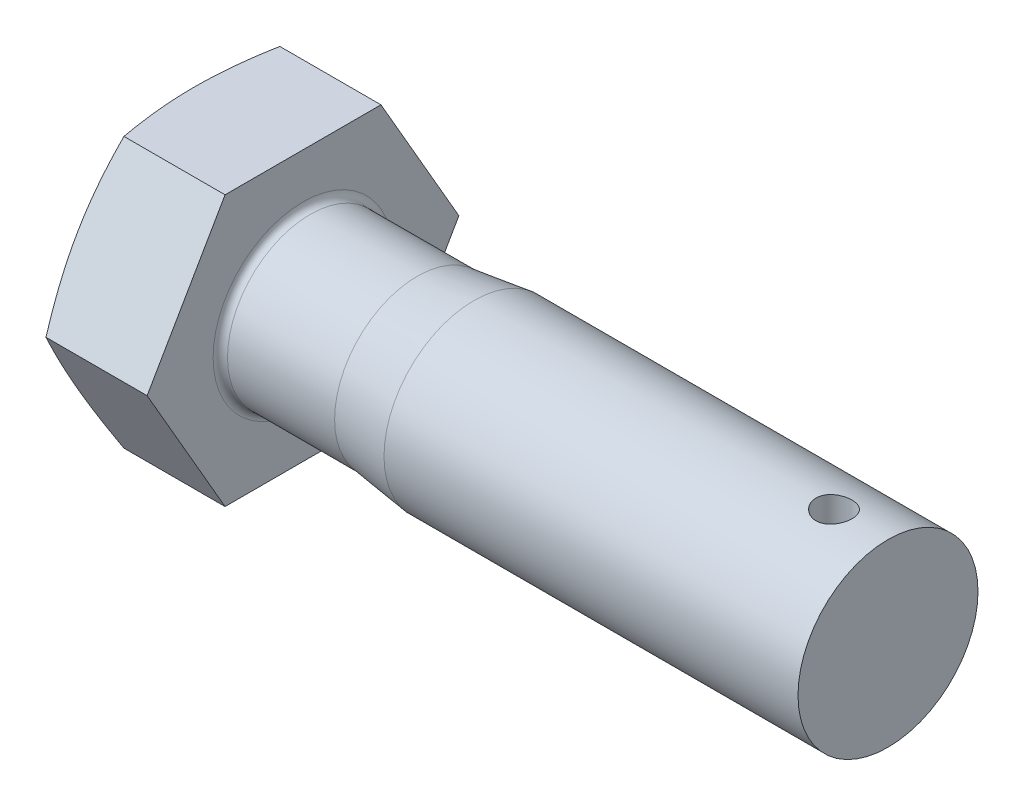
ISO-10303-21;
HEADER;
FILE_DESCRIPTION(('STEP AP214'),'2;1');
FILE_NAME('part.step','',(''),(''),'','','');
FILE_SCHEMA(('AUTOMOTIVE_DESIGN { 1 0 10303 214 1 1 1 1 }'));
ENDSEC;
DATA;
#1=APPLICATION_CONTEXT('core data for automotive mechanical design processes');
#2=APPLICATION_PROTOCOL_DEFINITION('international standard','automotive_design',2000,#1);
#3=PRODUCT_CONTEXT('',#1,'mechanical');
#4=PRODUCT('Part','Part','',(#3));
#5=PRODUCT_RELATED_PRODUCT_CATEGORY('part','',(#4));
#6=PRODUCT_DEFINITION_FORMATION('','',#4);
#7=PRODUCT_DEFINITION_CONTEXT('part definition',#1,'design');
#8=PRODUCT_DEFINITION('design','',#6,#7);
#9=PRODUCT_DEFINITION_SHAPE('','',#8);
#10=(LENGTH_UNIT() NAMED_UNIT(*) SI_UNIT(.MILLI.,.METRE.));
#11=(NAMED_UNIT(*) PLANE_ANGLE_UNIT() SI_UNIT($,.RADIAN.));
#12=(NAMED_UNIT(*) SI_UNIT($,.STERADIAN.) SOLID_ANGLE_UNIT());
#13=UNCERTAINTY_MEASURE_WITH_UNIT(LENGTH_MEASURE(1.E-05),#10,'distance_accuracy_value','');
#14=(GEOMETRIC_REPRESENTATION_CONTEXT(3) GLOBAL_UNCERTAINTY_ASSIGNED_CONTEXT((#13)) GLOBAL_UNIT_ASSIGNED_CONTEXT((#10,
#11,#12)) REPRESENTATION_CONTEXT('',''));
#15=CARTESIAN_POINT('',(0.,0.,0.));
#16=DIRECTION('',(0.,0.,1.));
#17=DIRECTION('',(1.,0.,0.));
#18=AXIS2_PLACEMENT_3D('',#15,#16,#17);
#19=CARTESIAN_POINT('',(0.,-15.,-8.66025403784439));
#20=DIRECTION('',(1.,0.,0.));
#21=DIRECTION('',(0.,0.,-1.));
#22=AXIS2_PLACEMENT_3D('',#19,#20,#21);
#23=PLANE('',#22);
#24=CARTESIAN_POINT('',(0.,0.,0.));
#25=DIRECTION('',(-1.,0.,0.));
#26=DIRECTION('',(0.,0.,1.));
#27=AXIS2_PLACEMENT_3D('',#24,#25,#26);
#28=CIRCLE('',#27,13.85);
#29=CARTESIAN_POINT('',(0.,0.,13.85));
#30=VERTEX_POINT('',#29);
#31=EDGE_CURVE('E98',#30,#30,#28,.T.);
#32=ORIENTED_EDGE('',*,*,#31,.T.);
#33=EDGE_LOOP('',(#32));
#34=FACE_BOUND('',#33,.T.);
#35=CARTESIAN_POINT('',(0.,0.,0.));
#36=DIRECTION('',(1.,0.,0.));
#37=DIRECTION('',(0.,0.,-1.));
#38=AXIS2_PLACEMENT_3D('',#35,#36,#37);
#39=CIRCLE('',#38,11.2);
#40=CARTESIAN_POINT('',(0.,0.,-11.2));
#41=VERTEX_POINT('',#40);
#42=EDGE_CURVE('E231',#41,#41,#39,.T.);
#43=ORIENTED_EDGE('',*,*,#42,.T.);
#44=EDGE_LOOP('',(#43));
#45=FACE_BOUND('',#44,.T.);
#46=ADVANCED_FACE('F32',(#34,#45),#23,.F.);
#47=CARTESIAN_POINT('',(12.5,-15.,8.66025403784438));
#48=DIRECTION('',(0.,1.,0.));
#49=DIRECTION('',(0.,0.,1.));
#50=AXIS2_PLACEMENT_3D('',#47,#48,#49);
#51=PLANE('',#50);
#52=CARTESIAN_POINT('',(4.91961642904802,-15.,-22.88945697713));
#53=CARTESIAN_POINT('',(4.81638202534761,-15.,-22.5503381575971));
#54=CARTESIAN_POINT('',(4.71377422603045,-15.,-22.2110286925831));
#55=CARTESIAN_POINT('',(4.50995213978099,-15.,-21.5319894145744));
#56=CARTESIAN_POINT('',(4.40873786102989,-15.,-21.1922595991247));
#57=CARTESIAN_POINT('',(4.10738262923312,-15.,-20.1723364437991));
#58=CARTESIAN_POINT('',(3.90954467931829,-15.,-19.4914598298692));
#59=CARTESIAN_POINT('',(3.5210601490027,-15.,-18.1262692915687));
#60=CARTESIAN_POINT('',(3.33042778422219,-15.,-17.4419513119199));
#61=CARTESIAN_POINT('',(2.95858022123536,-15.,-16.0707644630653));
#62=CARTESIAN_POINT('',(2.7773648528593,-15.,-15.383895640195));
#63=CARTESIAN_POINT('',(2.42886947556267,-15.,-14.01571316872));
#64=CARTESIAN_POINT('',(2.2614441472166,-15.,-13.3344367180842));
#65=CARTESIAN_POINT('',(1.94090770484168,-15.,-11.9684892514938));
#66=CARTESIAN_POINT('',(1.78779683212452,-15.,-11.283818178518));
#67=CARTESIAN_POINT('',(1.49947213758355,-15.,-9.91093551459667));
#68=CARTESIAN_POINT('',(1.36425207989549,-15.,-9.22272524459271));
#69=CARTESIAN_POINT('',(1.11583728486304,-15.,-7.842311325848));
#70=CARTESIAN_POINT('',(1.00264180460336,-15.,-7.15010781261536));
#71=CARTESIAN_POINT('',(0.81409545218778,-15.,-5.83972391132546));
#72=CARTESIAN_POINT('',(0.735923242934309,-15.,-5.22195329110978));
#73=CARTESIAN_POINT('',(0.603729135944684,-15.,-3.98381199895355));
#74=CARTESIAN_POINT('',(0.549706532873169,-15.,-3.36344140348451));
#75=CARTESIAN_POINT('',(0.468413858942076,-15.,-2.12135926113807));
#76=CARTESIAN_POINT('',(0.441125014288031,-15.,-1.49964896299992));
#77=CARTESIAN_POINT('',(0.414680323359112,-15.,-0.255623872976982));
#78=CARTESIAN_POINT('',(0.415524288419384,-15.,0.366690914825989));
#79=CARTESIAN_POINT('',(0.445375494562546,-15.,1.61382375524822));
#80=CARTESIAN_POINT('',(0.474527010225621,-15.,2.23863829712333));
#81=CARTESIAN_POINT('',(0.559653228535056,-15.,3.4864216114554));
#82=CARTESIAN_POINT('',(0.615628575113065,-15.,4.10939033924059));
#83=CARTESIAN_POINT('',(0.751792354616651,-15.,5.35317883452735));
#84=CARTESIAN_POINT('',(0.832001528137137,-15.,5.97399629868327));
#85=CARTESIAN_POINT('',(1.01339112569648,-15.,7.21252509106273));
#86=CARTESIAN_POINT('',(1.11457165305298,-15.,7.83023640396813));
#87=CARTESIAN_POINT('',(1.3410206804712,-15.,9.09829177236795));
#88=CARTESIAN_POINT('',(1.4673476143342,-15.,9.74844514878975));
#89=CARTESIAN_POINT('',(1.73625904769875,-15.,11.0454025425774));
#90=CARTESIAN_POINT('',(1.87884478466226,-15.,11.6922063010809));
#91=CARTESIAN_POINT('',(2.1772678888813,-15.,12.9829308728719));
#92=CARTESIAN_POINT('',(2.3331091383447,-15.,13.6268507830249));
#93=CARTESIAN_POINT('',(2.65550076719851,-15.,14.9119744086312));
#94=CARTESIAN_POINT('',(2.82205088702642,-15.,15.553178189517));
#95=CARTESIAN_POINT('',(3.16407229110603,-15.,16.8340800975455));
#96=CARTESIAN_POINT('',(3.33955481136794,-15.,17.4737752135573));
#97=CARTESIAN_POINT('',(3.69763660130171,-15.,18.7511677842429));
#98=CARTESIAN_POINT('',(3.88023590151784,-15.,19.3888652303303));
#99=CARTESIAN_POINT('',(4.25124466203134,-15.,20.6624469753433));
#100=CARTESIAN_POINT('',(4.43965313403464,-15.,21.2983315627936));
#101=CARTESIAN_POINT('',(4.82129800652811,-15.,22.5686463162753));
#102=CARTESIAN_POINT('',(5.01453439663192,-15.,23.2030764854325));
#103=CARTESIAN_POINT('',(5.40282045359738,-15.,24.4635306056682));
#104=CARTESIAN_POINT('',(5.59782491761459,-15.,25.0895684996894));
#105=CARTESIAN_POINT('',(5.99114351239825,-15.,26.3406044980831));
#106=CARTESIAN_POINT('',(6.18945765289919,-15.,26.9656025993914));
#107=CARTESIAN_POINT('',(6.78859722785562,-15.,28.8393146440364));
#108=CARTESIAN_POINT('',(7.19360294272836,-15.,30.086691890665));
#109=CARTESIAN_POINT('',(8.01018214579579,-15.,32.5740343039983));
#110=CARTESIAN_POINT('',(8.42172481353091,-15.,33.8140096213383));
#111=CARTESIAN_POINT('',(9.04358172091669,-15.,35.6723940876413));
#112=CARTESIAN_POINT('',(9.25161601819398,-15.,36.29156752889));
#113=CARTESIAN_POINT('',(9.66902287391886,-15.,37.5294615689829));
#114=CARTESIAN_POINT('',(9.87839542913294,-15.,38.1481821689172));
#115=CARTESIAN_POINT('',(10.0883469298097,-15.,38.7667061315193));
#116=B_SPLINE_CURVE_WITH_KNOTS('',3,(#52,#53,#54,#55,#56,#57,#58,#59,#60,#61,#62,#63,#64,#65,
#66,#67,#68,#69,#70,#71,#72,#73,#74,#75,#76,#77,#78,#79,#80,#81,#82,#83,#84,#85,#86,#87,#88,#89,
#90,#91,#92,#93,#94,#95,#96,#97,#98,#99,#100,#101,#102,#103,#104,#105,#106,#107,#108,#109,#110,
#111,#112,#113,#114,#115),.UNSPECIFIED.,.F.,.F.,(4,2,2,2,2,2,2,2,2,2,2,2,2,2,2,2,2,2,2,2,2,2,2,
2,2,2,2,2,2,2,2,4),(0.,1.06345090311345,2.12690804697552,4.25398052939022,6.38505099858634,
8.51608294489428,10.6206032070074,12.7251589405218,14.8289791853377,16.9327284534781,
18.8004079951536,20.6680329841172,22.5343454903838,24.4006454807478,26.2765076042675,
28.1524147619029,30.0299319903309,31.9074584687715,33.8941406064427,35.8809740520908,
37.8683914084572,39.8557606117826,41.8456946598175,43.8356372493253,45.8252431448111,
47.8148447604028,49.7819514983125,51.7490640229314,55.6834600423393,59.6028993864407,
61.5624608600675,63.5220176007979),.UNSPECIFIED.);
#117=CARTESIAN_POINT('',(1.26316163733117,-15.,-8.66025403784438));
#118=VERTEX_POINT('',#117);
#119=CARTESIAN_POINT('',(1.26316163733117,-15.,8.66025403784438));
#120=VERTEX_POINT('',#119);
#121=EDGE_CURVE('E54',#118,#120,#116,.T.);
#122=ORIENTED_EDGE('',*,*,#121,.F.);
#123=DIRECTION('',(-1.,0.,0.));
#124=VECTOR('',#123,1.);
#125=CARTESIAN_POINT('',(12.5,-15.,-8.66025403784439));
#126=LINE('',#125,#124);
#127=CARTESIAN_POINT('',(12.5,-15.,-8.66025403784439));
#128=VERTEX_POINT('',#127);
#129=EDGE_CURVE('E123',#128,#118,#126,.T.);
#130=ORIENTED_EDGE('',*,*,#129,.F.);
#131=DIRECTION('',(0.,0.,-1.));
#132=VECTOR('',#131,1.);
#133=CARTESIAN_POINT('',(12.5,-15.,8.66025403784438));
#134=LINE('',#133,#132);
#135=CARTESIAN_POINT('',(12.5,-15.,8.66025403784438));
#136=VERTEX_POINT('',#135);
#137=EDGE_CURVE('E260',#136,#128,#134,.T.);
#138=ORIENTED_EDGE('',*,*,#137,.F.);
#139=DIRECTION('',(-1.,0.,0.));
#140=VECTOR('',#139,1.);
#141=CARTESIAN_POINT('',(12.5,-15.,8.66025403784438));
#142=LINE('',#141,#140);
#143=EDGE_CURVE('E111',#136,#120,#142,.T.);
#144=ORIENTED_EDGE('',*,*,#143,.T.);
#145=EDGE_LOOP('',(#122,#130,#138,#144));
#146=FACE_BOUND('',#145,.T.);
#147=ADVANCED_FACE('F34',(#146),#51,.F.);
#148=CARTESIAN_POINT('',(12.5,-15.,-8.66025403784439));
#149=DIRECTION('',(0.,0.5,0.866025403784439));
#150=DIRECTION('',(0.,-0.866025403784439,0.5));
#151=AXIS2_PLACEMENT_3D('',#148,#149,#150);
#152=PLANE('',#151);
#153=CARTESIAN_POINT('',(1.26320366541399,0.000200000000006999,-17.3206235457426));
#154=CARTESIAN_POINT('',(1.19793003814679,-0.310443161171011,-17.1412736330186));
#155=CARTESIAN_POINT('',(1.13559192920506,-0.621542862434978,-16.961660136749));
#156=CARTESIAN_POINT('',(1.017432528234,-1.24469773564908,-16.6018815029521));
#157=CARTESIAN_POINT('',(0.961611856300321,-1.55675299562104,-16.4217163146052));
#158=CARTESIAN_POINT('',(0.804840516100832,-2.49475901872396,-15.8801582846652));
#159=CARTESIAN_POINT('',(0.714672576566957,-3.12212058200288,-15.5179509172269));
#160=CARTESIAN_POINT('',(0.6050895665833,-4.06237563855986,-14.9750944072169));
#161=CARTESIAN_POINT('',(0.572932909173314,-4.37418429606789,-14.7950715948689));
#162=CARTESIAN_POINT('',(0.517400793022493,-4.9983837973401,-14.4346898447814));
#163=CARTESIAN_POINT('',(0.494024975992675,-5.31077461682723,-14.2543309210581));
#164=CARTESIAN_POINT('',(0.456462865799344,-5.93586386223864,-13.8934354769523));
#165=CARTESIAN_POINT('',(0.442273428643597,-6.24856214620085,-13.7128990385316));
#166=CARTESIAN_POINT('',(0.42332489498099,-6.87417362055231,-13.3517020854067));
#167=CARTESIAN_POINT('',(0.418565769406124,-7.18708681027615,-13.1710415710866));
#168=CARTESIAN_POINT('',(0.418565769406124,-7.81291318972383,-12.8097205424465));
#169=CARTESIAN_POINT('',(0.42332489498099,-8.12582637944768,-12.6290600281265));
#170=CARTESIAN_POINT('',(0.442273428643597,-8.75143785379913,-12.2678630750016));
#171=CARTESIAN_POINT('',(0.456462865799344,-9.06413613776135,-12.0873266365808));
#172=CARTESIAN_POINT('',(0.494024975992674,-9.68922538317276,-11.726431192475));
#173=CARTESIAN_POINT('',(0.517400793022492,-10.0016162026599,-11.5460722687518));
#174=CARTESIAN_POINT('',(0.572932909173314,-10.6258157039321,-11.1856905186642));
#175=CARTESIAN_POINT('',(0.605089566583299,-10.9376243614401,-11.0056677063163));
#176=CARTESIAN_POINT('',(0.714672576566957,-11.8778794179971,-10.4628111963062));
#177=CARTESIAN_POINT('',(0.804840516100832,-12.505240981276,-10.1006038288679));
#178=CARTESIAN_POINT('',(0.96161185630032,-13.4432470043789,-9.55904579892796));
#179=CARTESIAN_POINT('',(1.01743252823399,-13.7553022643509,-9.3788806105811));
#180=CARTESIAN_POINT('',(1.13559192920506,-14.378457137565,-9.01910197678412));
#181=CARTESIAN_POINT('',(1.19793003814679,-14.689556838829,-8.83948848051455));
#182=CARTESIAN_POINT('',(1.26320366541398,-15.0002,-8.66013856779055));
#183=B_SPLINE_CURVE_WITH_KNOTS('',3,(#153,#154,#155,#156,#157,#158,#159,#160,#161,#162,#163,
#164,#165,#166,#167,#168,#169,#170,#171,#172,#173,#174,#175,#176,#177,#178,#179,#180,#181,#182),
.UNSPECIFIED.,.F.,.F.,(4,2,2,2,2,2,2,2,2,2,2,2,2,2,4),(0.,1.0937389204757,2.18758181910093,
4.37677976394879,5.46113055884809,6.54543710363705,7.62937235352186,8.71330426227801,
9.79723617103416,10.881171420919,11.9654779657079,13.0498287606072,15.2390267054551,
16.3328696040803,17.426608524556),.UNSPECIFIED.);
#184=CARTESIAN_POINT('',(1.26316163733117,0.,-17.3205080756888));
#185=VERTEX_POINT('',#184);
#186=EDGE_CURVE('E193',#185,#118,#183,.T.);
#187=ORIENTED_EDGE('',*,*,#186,.F.);
#188=DIRECTION('',(-1.,0.,0.));
#189=VECTOR('',#188,1.);
#190=CARTESIAN_POINT('',(12.5,0.,-17.3205080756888));
#191=LINE('',#190,#189);
#192=CARTESIAN_POINT('',(12.5,0.,-17.3205080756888));
#193=VERTEX_POINT('',#192);
#194=EDGE_CURVE('E120',#193,#185,#191,.T.);
#195=ORIENTED_EDGE('',*,*,#194,.F.);
#196=DIRECTION('',(0.,0.866025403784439,-0.5));
#197=VECTOR('',#196,1.);
#198=CARTESIAN_POINT('',(12.5,-15.,-8.66025403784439));
#199=LINE('',#198,#197);
#200=EDGE_CURVE('E261',#128,#193,#199,.T.);
#201=ORIENTED_EDGE('',*,*,#200,.F.);
#202=ORIENTED_EDGE('',*,*,#129,.T.);
#203=EDGE_LOOP('',(#187,#195,#201,#202));
#204=FACE_BOUND('',#203,.T.);
#205=ADVANCED_FACE('F201',(#204),#152,.F.);
#206=CARTESIAN_POINT('',(12.5,0.,-17.3205080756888));
#207=DIRECTION('',(0.,-0.5,0.866025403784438));
#208=DIRECTION('',(0.,-0.866025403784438,-0.5));
#209=AXIS2_PLACEMENT_3D('',#206,#207,#208);
#210=PLANE('',#209);
#211=CARTESIAN_POINT('',(1.26320366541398,15.0002,-8.66013856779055));
#212=CARTESIAN_POINT('',(1.19793003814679,14.689556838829,-8.83948848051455));
#213=CARTESIAN_POINT('',(1.13559192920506,14.378457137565,-9.01910197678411));
#214=CARTESIAN_POINT('',(1.017432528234,13.7553022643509,-9.3788806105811));
#215=CARTESIAN_POINT('',(0.961611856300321,13.443247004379,-9.55904579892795));
#216=CARTESIAN_POINT('',(0.804840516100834,12.505240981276,-10.1006038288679));
#217=CARTESIAN_POINT('',(0.714672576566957,11.8778794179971,-10.4628111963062));
#218=CARTESIAN_POINT('',(0.6050895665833,10.9376243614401,-11.0056677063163));
#219=CARTESIAN_POINT('',(0.572932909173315,10.6258157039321,-11.1856905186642));
#220=CARTESIAN_POINT('',(0.517400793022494,10.0016162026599,-11.5460722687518));
#221=CARTESIAN_POINT('',(0.494024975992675,9.68922538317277,-11.726431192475));
#222=CARTESIAN_POINT('',(0.456462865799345,9.06413613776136,-12.0873266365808));
#223=CARTESIAN_POINT('',(0.442273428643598,8.75143785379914,-12.2678630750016));
#224=CARTESIAN_POINT('',(0.423324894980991,8.12582637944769,-12.6290600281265));
#225=CARTESIAN_POINT('',(0.418565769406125,7.81291318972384,-12.8097205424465));
#226=CARTESIAN_POINT('',(0.418565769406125,7.18708681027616,-13.1710415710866));
#227=CARTESIAN_POINT('',(0.423324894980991,6.87417362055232,-13.3517020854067));
#228=CARTESIAN_POINT('',(0.442273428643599,6.24856214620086,-13.7128990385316));
#229=CARTESIAN_POINT('',(0.456462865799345,5.93586386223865,-13.8934354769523));
#230=CARTESIAN_POINT('',(0.494024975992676,5.31077461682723,-14.2543309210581));
#231=CARTESIAN_POINT('',(0.517400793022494,4.99838379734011,-14.4346898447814));
#232=CARTESIAN_POINT('',(0.572932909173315,4.3741842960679,-14.7950715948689));
#233=CARTESIAN_POINT('',(0.6050895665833,4.06237563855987,-14.9750944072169));
#234=CARTESIAN_POINT('',(0.714672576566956,3.12212058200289,-15.5179509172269));
#235=CARTESIAN_POINT('',(0.804840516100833,2.49475901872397,-15.8801582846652));
#236=CARTESIAN_POINT('',(0.961611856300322,1.55675299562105,-16.4217163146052));
#237=CARTESIAN_POINT('',(1.017432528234,1.24469773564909,-16.6018815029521));
#238=CARTESIAN_POINT('',(1.13559192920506,0.621542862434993,-16.961660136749));
#239=CARTESIAN_POINT('',(1.19793003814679,0.310443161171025,-17.1412736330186));
#240=CARTESIAN_POINT('',(1.26320366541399,-0.000199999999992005,-17.3206235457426));
#241=B_SPLINE_CURVE_WITH_KNOTS('',3,(#211,#212,#213,#214,#215,#216,#217,#218,#219,#220,#221,
#222,#223,#224,#225,#226,#227,#228,#229,#230,#231,#232,#233,#234,#235,#236,#237,#238,#239,#240),
.UNSPECIFIED.,.F.,.F.,(4,2,2,2,2,2,2,2,2,2,2,2,2,2,4),(0.,1.0937389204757,2.18758181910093,
4.37677976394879,5.46113055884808,6.54543710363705,7.62937235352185,8.71330426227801,
9.79723617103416,10.881171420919,11.9654779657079,13.0498287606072,15.2390267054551,
16.3328696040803,17.426608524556),.UNSPECIFIED.);
#242=CARTESIAN_POINT('',(1.26316163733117,15.,-8.6602540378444));
#243=VERTEX_POINT('',#242);
#244=EDGE_CURVE('E187',#243,#185,#241,.T.);
#245=ORIENTED_EDGE('',*,*,#244,.F.);
#246=DIRECTION('',(-1.,0.,0.));
#247=VECTOR('',#246,1.);
#248=CARTESIAN_POINT('',(12.5,15.,-8.66025403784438));
#249=LINE('',#248,#247);
#250=CARTESIAN_POINT('',(12.5,15.,-8.66025403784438));
#251=VERTEX_POINT('',#250);
#252=EDGE_CURVE('E113',#251,#243,#249,.T.);
#253=ORIENTED_EDGE('',*,*,#252,.F.);
#254=DIRECTION('',(0.,0.866025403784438,0.5));
#255=VECTOR('',#254,1.);
#256=CARTESIAN_POINT('',(12.5,0.,-17.3205080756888));
#257=LINE('',#256,#255);
#258=EDGE_CURVE('E265',#193,#251,#257,.T.);
#259=ORIENTED_EDGE('',*,*,#258,.F.);
#260=ORIENTED_EDGE('',*,*,#194,.T.);
#261=EDGE_LOOP('',(#245,#253,#259,#260));
#262=FACE_BOUND('',#261,.T.);
#263=ADVANCED_FACE('F204',(#262),#210,.F.);
#264=CARTESIAN_POINT('',(12.5,15.,-8.66025403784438));
#265=DIRECTION('',(0.,-1.,0.));
#266=DIRECTION('',(0.,0.,-1.));
#267=AXIS2_PLACEMENT_3D('',#264,#265,#266);
#268=PLANE('',#267);
#269=CARTESIAN_POINT('',(4.91961642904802,15.,-22.88945697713));
#270=CARTESIAN_POINT('',(4.8163820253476,15.,-22.5503381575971));
#271=CARTESIAN_POINT('',(4.71377422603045,15.,-22.2110286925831));
#272=CARTESIAN_POINT('',(4.50995213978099,15.,-21.5319894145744));
#273=CARTESIAN_POINT('',(4.40873786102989,15.,-21.1922595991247));
#274=CARTESIAN_POINT('',(4.10738262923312,15.,-20.1723364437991));
#275=CARTESIAN_POINT('',(3.90954467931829,15.,-19.4914598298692));
#276=CARTESIAN_POINT('',(3.5210601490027,15.,-18.1262692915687));
#277=CARTESIAN_POINT('',(3.33042778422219,15.,-17.4419513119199));
#278=CARTESIAN_POINT('',(2.95858022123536,15.,-16.0707644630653));
#279=CARTESIAN_POINT('',(2.7773648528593,15.,-15.383895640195));
#280=CARTESIAN_POINT('',(2.42886947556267,15.,-14.01571316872));
#281=CARTESIAN_POINT('',(2.2614441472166,15.,-13.3344367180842));
#282=CARTESIAN_POINT('',(1.94090770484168,15.,-11.9684892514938));
#283=CARTESIAN_POINT('',(1.78779683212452,15.,-11.283818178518));
#284=CARTESIAN_POINT('',(1.49947213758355,15.,-9.91093551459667));
#285=CARTESIAN_POINT('',(1.36425207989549,15.,-9.22272524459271));
#286=CARTESIAN_POINT('',(1.11583728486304,15.,-7.842311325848));
#287=CARTESIAN_POINT('',(1.00264180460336,15.,-7.15010781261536));
#288=CARTESIAN_POINT('',(0.814095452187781,15.,-5.83972391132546));
#289=CARTESIAN_POINT('',(0.735923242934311,15.,-5.22195329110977));
#290=CARTESIAN_POINT('',(0.603729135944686,15.,-3.98381199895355));
#291=CARTESIAN_POINT('',(0.549706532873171,15.,-3.36344140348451));
#292=CARTESIAN_POINT('',(0.468413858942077,15.,-2.12135926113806));
#293=CARTESIAN_POINT('',(0.441125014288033,15.,-1.49964896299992));
#294=CARTESIAN_POINT('',(0.414680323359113,15.,-0.255623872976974));
#295=CARTESIAN_POINT('',(0.415524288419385,15.,0.366690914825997));
#296=CARTESIAN_POINT('',(0.445375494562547,15.,1.61382375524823));
#297=CARTESIAN_POINT('',(0.474527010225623,15.,2.23863829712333));
#298=CARTESIAN_POINT('',(0.559653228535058,15.,3.48642161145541));
#299=CARTESIAN_POINT('',(0.615628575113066,15.,4.1093903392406));
#300=CARTESIAN_POINT('',(0.751792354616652,15.,5.35317883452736));
#301=CARTESIAN_POINT('',(0.832001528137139,15.,5.97399629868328));
#302=CARTESIAN_POINT('',(1.01339112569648,15.,7.21252509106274));
#303=CARTESIAN_POINT('',(1.11457165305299,15.,7.83023640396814));
#304=CARTESIAN_POINT('',(1.3410206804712,15.,9.09829177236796));
#305=CARTESIAN_POINT('',(1.46734761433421,15.,9.74844514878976));
#306=CARTESIAN_POINT('',(1.73625904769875,15.,11.0454025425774));
#307=CARTESIAN_POINT('',(1.87884478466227,15.,11.6922063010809));
#308=CARTESIAN_POINT('',(2.17726788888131,15.,12.982930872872));
#309=CARTESIAN_POINT('',(2.33310913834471,15.,13.626850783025));
#310=CARTESIAN_POINT('',(2.65550076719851,15.,14.9119744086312));
#311=CARTESIAN_POINT('',(2.82205088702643,15.,15.553178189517));
#312=CARTESIAN_POINT('',(3.16407229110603,15.,16.8340800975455));
#313=CARTESIAN_POINT('',(3.33955481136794,15.,17.4737752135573));
#314=CARTESIAN_POINT('',(3.69763660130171,15.,18.7511677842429));
#315=CARTESIAN_POINT('',(3.88023590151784,15.,19.3888652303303));
#316=CARTESIAN_POINT('',(4.25124466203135,15.,20.6624469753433));
#317=CARTESIAN_POINT('',(4.43965313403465,15.,21.2983315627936));
#318=CARTESIAN_POINT('',(4.82129800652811,15.,22.5686463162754));
#319=CARTESIAN_POINT('',(5.01453439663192,15.,23.2030764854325));
#320=CARTESIAN_POINT('',(5.40282045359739,15.,24.4635306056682));
#321=CARTESIAN_POINT('',(5.59782491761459,15.,25.0895684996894));
#322=CARTESIAN_POINT('',(5.99114351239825,15.,26.3406044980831));
#323=CARTESIAN_POINT('',(6.18945765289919,15.,26.9656025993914));
#324=CARTESIAN_POINT('',(6.78859722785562,15.,28.8393146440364));
#325=CARTESIAN_POINT('',(7.19360294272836,15.,30.086691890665));
#326=CARTESIAN_POINT('',(8.0101821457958,15.,32.5740343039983));
#327=CARTESIAN_POINT('',(8.42172481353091,15.,33.8140096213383));
#328=CARTESIAN_POINT('',(9.04358172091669,15.,35.6723940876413));
#329=CARTESIAN_POINT('',(9.25161601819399,15.,36.29156752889));
#330=CARTESIAN_POINT('',(9.66902287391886,15.,37.5294615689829));
#331=CARTESIAN_POINT('',(9.87839542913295,15.,38.1481821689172));
#332=CARTESIAN_POINT('',(10.0883469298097,15.,38.7667061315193));
#333=B_SPLINE_CURVE_WITH_KNOTS('',3,(#269,#270,#271,#272,#273,#274,#275,#276,#277,#278,#279,
#280,#281,#282,#283,#284,#285,#286,#287,#288,#289,#290,#291,#292,#293,#294,#295,#296,#297,#298,
#299,#300,#301,#302,#303,#304,#305,#306,#307,#308,#309,#310,#311,#312,#313,#314,#315,#316,#317,
#318,#319,#320,#321,#322,#323,#324,#325,#326,#327,#328,#329,#330,#331,#332),.UNSPECIFIED.,.F.,
.F.,(4,2,2,2,2,2,2,2,2,2,2,2,2,2,2,2,2,2,2,2,2,2,2,2,2,2,2,2,2,2,2,4),(0.,1.06345090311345,
2.12690804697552,4.25398052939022,6.38505099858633,8.51608294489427,10.6206032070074,
12.7251589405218,14.8289791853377,16.9327284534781,18.8004079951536,20.6680329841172,
22.5343454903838,24.4006454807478,26.2765076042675,28.1524147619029,30.0299319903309,
31.9074584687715,33.8941406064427,35.8809740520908,37.8683914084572,39.8557606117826,
41.8456946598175,43.8356372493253,45.8252431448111,47.8148447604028,49.7819514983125,
51.7490640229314,55.6834600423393,59.6028993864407,61.5624608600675,63.5220176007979),.UNSPECIFIED.);
#334=CARTESIAN_POINT('',(1.26316163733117,15.,8.66025403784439));
#335=VERTEX_POINT('',#334);
#336=EDGE_CURVE('E108',#335,#243,#333,.F.);
#337=ORIENTED_EDGE('',*,*,#336,.F.);
#338=DIRECTION('',(-1.,0.,0.));
#339=VECTOR('',#338,1.);
#340=CARTESIAN_POINT('',(12.5,15.,8.66025403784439));
#341=LINE('',#340,#339);
#342=CARTESIAN_POINT('',(12.5,15.,8.66025403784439));
#343=VERTEX_POINT('',#342);
#344=EDGE_CURVE('E107',#343,#335,#341,.T.);
#345=ORIENTED_EDGE('',*,*,#344,.F.);
#346=DIRECTION('',(0.,0.,1.));
#347=VECTOR('',#346,1.);
#348=CARTESIAN_POINT('',(12.5,15.,-8.66025403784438));
#349=LINE('',#348,#347);
#350=EDGE_CURVE('E267',#251,#343,#349,.T.);
#351=ORIENTED_EDGE('',*,*,#350,.F.);
#352=ORIENTED_EDGE('',*,*,#252,.T.);
#353=EDGE_LOOP('',(#337,#345,#351,#352));
#354=FACE_BOUND('',#353,.T.);
#355=ADVANCED_FACE('F208',(#354),#268,.F.);
#356=CARTESIAN_POINT('',(12.5,15.,8.66025403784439));
#357=DIRECTION('',(0.,-0.5,-0.866025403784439));
#358=DIRECTION('',(0.,0.866025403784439,-0.5));
#359=AXIS2_PLACEMENT_3D('',#356,#357,#358);
#360=PLANE('',#359);
#361=CARTESIAN_POINT('',(1.26320366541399,-0.000199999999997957,17.3206235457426));
#362=CARTESIAN_POINT('',(1.1979300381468,0.310443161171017,17.1412736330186));
#363=CARTESIAN_POINT('',(1.13559192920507,0.621542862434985,16.961660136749));
#364=CARTESIAN_POINT('',(1.017432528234,1.24469773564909,16.6018815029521));
#365=CARTESIAN_POINT('',(0.961611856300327,1.55675299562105,16.4217163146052));
#366=CARTESIAN_POINT('',(0.804840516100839,2.49475901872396,15.8801582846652));
#367=CARTESIAN_POINT('',(0.714672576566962,3.12212058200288,15.5179509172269));
#368=CARTESIAN_POINT('',(0.605089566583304,4.06237563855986,14.9750944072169));
#369=CARTESIAN_POINT('',(0.572932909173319,4.37418429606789,14.7950715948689));
#370=CARTESIAN_POINT('',(0.517400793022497,4.99838379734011,14.4346898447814));
#371=CARTESIAN_POINT('',(0.494024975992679,5.31077461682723,14.2543309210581));
#372=CARTESIAN_POINT('',(0.456462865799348,5.93586386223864,13.8934354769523));
#373=CARTESIAN_POINT('',(0.442273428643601,6.24856214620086,13.7128990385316));
#374=CARTESIAN_POINT('',(0.423324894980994,6.87417362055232,13.3517020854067));
#375=CARTESIAN_POINT('',(0.418565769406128,7.18708681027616,13.1710415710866));
#376=CARTESIAN_POINT('',(0.418565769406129,7.81291318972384,12.8097205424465));
#377=CARTESIAN_POINT('',(0.423324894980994,8.12582637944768,12.6290600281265));
#378=CARTESIAN_POINT('',(0.442273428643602,8.75143785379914,12.2678630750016));
#379=CARTESIAN_POINT('',(0.456462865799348,9.06413613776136,12.0873266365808));
#380=CARTESIAN_POINT('',(0.494024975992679,9.68922538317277,11.726431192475));
#381=CARTESIAN_POINT('',(0.517400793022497,10.0016162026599,11.5460722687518));
#382=CARTESIAN_POINT('',(0.572932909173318,10.6258157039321,11.1856905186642));
#383=CARTESIAN_POINT('',(0.605089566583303,10.9376243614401,11.0056677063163));
#384=CARTESIAN_POINT('',(0.71467257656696,11.8778794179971,10.4628111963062));
#385=CARTESIAN_POINT('',(0.804840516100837,12.505240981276,10.1006038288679));
#386=CARTESIAN_POINT('',(0.961611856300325,13.443247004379,9.55904579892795));
#387=CARTESIAN_POINT('',(1.017432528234,13.7553022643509,9.3788806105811));
#388=CARTESIAN_POINT('',(1.13559192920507,14.378457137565,9.01910197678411));
#389=CARTESIAN_POINT('',(1.19793003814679,14.689556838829,8.83948848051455));
#390=CARTESIAN_POINT('',(1.26320366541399,15.0002,8.66013856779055));
#391=B_SPLINE_CURVE_WITH_KNOTS('',3,(#361,#362,#363,#364,#365,#366,#367,#368,#369,#370,#371,
#372,#373,#374,#375,#376,#377,#378,#379,#380,#381,#382,#383,#384,#385,#386,#387,#388,#389,#390),
.UNSPECIFIED.,.F.,.F.,(4,2,2,2,2,2,2,2,2,2,2,2,2,2,4),(0.,1.0937389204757,2.18758181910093,
4.37677976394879,5.46113055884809,6.54543710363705,7.62937235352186,8.71330426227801,
9.79723617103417,10.881171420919,11.9654779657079,13.0498287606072,15.2390267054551,
16.3328696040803,17.426608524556),.UNSPECIFIED.);
#392=CARTESIAN_POINT('',(1.26316163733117,0.,17.3205080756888));
#393=VERTEX_POINT('',#392);
#394=EDGE_CURVE('E93',#393,#335,#391,.T.);
#395=ORIENTED_EDGE('',*,*,#394,.F.);
#396=DIRECTION('',(-1.,0.,0.));
#397=VECTOR('',#396,1.);
#398=CARTESIAN_POINT('',(12.5,0.,17.3205080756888));
#399=LINE('',#398,#397);
#400=CARTESIAN_POINT('',(12.5,0.,17.3205080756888));
#401=VERTEX_POINT('',#400);
#402=EDGE_CURVE('E105',#401,#393,#399,.T.);
#403=ORIENTED_EDGE('',*,*,#402,.F.);
#404=DIRECTION('',(0.,-0.866025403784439,0.5));
#405=VECTOR('',#404,1.);
#406=CARTESIAN_POINT('',(12.5,15.,8.66025403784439));
#407=LINE('',#406,#405);
#408=EDGE_CURVE('E269',#343,#401,#407,.T.);
#409=ORIENTED_EDGE('',*,*,#408,.F.);
#410=ORIENTED_EDGE('',*,*,#344,.T.);
#411=EDGE_LOOP('',(#395,#403,#409,#410));
#412=FACE_BOUND('',#411,.T.);
#413=ADVANCED_FACE('F103',(#412),#360,.F.);
#414=CARTESIAN_POINT('',(12.5,0.,17.3205080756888));
#415=DIRECTION('',(0.,0.5,-0.866025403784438));
#416=DIRECTION('',(0.,0.866025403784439,0.5));
#417=AXIS2_PLACEMENT_3D('',#414,#415,#416);
#418=PLANE('',#417);
#419=CARTESIAN_POINT('',(1.26320366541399,-15.0002,8.66013856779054));
#420=CARTESIAN_POINT('',(1.19793003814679,-14.689556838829,8.83948848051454));
#421=CARTESIAN_POINT('',(1.13559192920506,-14.378457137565,9.01910197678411));
#422=CARTESIAN_POINT('',(1.017432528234,-13.7553022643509,9.3788806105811));
#423=CARTESIAN_POINT('',(0.961611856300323,-13.443247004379,9.55904579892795));
#424=CARTESIAN_POINT('',(0.804840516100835,-12.505240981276,10.1006038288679));
#425=CARTESIAN_POINT('',(0.714672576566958,-11.8778794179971,10.4628111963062));
#426=CARTESIAN_POINT('',(0.605089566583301,-10.9376243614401,11.0056677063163));
#427=CARTESIAN_POINT('',(0.572932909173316,-10.6258157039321,11.1856905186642));
#428=CARTESIAN_POINT('',(0.517400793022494,-10.0016162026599,11.5460722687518));
#429=CARTESIAN_POINT('',(0.494024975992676,-9.68922538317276,11.726431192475));
#430=CARTESIAN_POINT('',(0.456462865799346,-9.06413613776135,12.0873266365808));
#431=CARTESIAN_POINT('',(0.442273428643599,-8.75143785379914,12.2678630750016));
#432=CARTESIAN_POINT('',(0.423324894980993,-8.12582637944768,12.6290600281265));
#433=CARTESIAN_POINT('',(0.418565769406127,-7.81291318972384,12.8097205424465));
#434=CARTESIAN_POINT('',(0.418565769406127,-7.18708681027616,13.1710415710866));
#435=CARTESIAN_POINT('',(0.423324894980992,-6.87417362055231,13.3517020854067));
#436=CARTESIAN_POINT('',(0.4422734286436,-6.24856214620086,13.7128990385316));
#437=CARTESIAN_POINT('',(0.456462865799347,-5.93586386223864,13.8934354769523));
#438=CARTESIAN_POINT('',(0.494024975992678,-5.31077461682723,14.2543309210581));
#439=CARTESIAN_POINT('',(0.517400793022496,-4.99838379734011,14.4346898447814));
#440=CARTESIAN_POINT('',(0.572932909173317,-4.37418429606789,14.7950715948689));
#441=CARTESIAN_POINT('',(0.605089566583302,-4.06237563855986,14.9750944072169));
#442=CARTESIAN_POINT('',(0.71467257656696,-3.12212058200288,15.5179509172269));
#443=CARTESIAN_POINT('',(0.804840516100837,-2.49475901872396,15.8801582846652));
#444=CARTESIAN_POINT('',(0.961611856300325,-1.55675299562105,16.4217163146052));
#445=CARTESIAN_POINT('',(1.017432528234,-1.24469773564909,16.6018815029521));
#446=CARTESIAN_POINT('',(1.13559192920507,-0.621542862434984,16.961660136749));
#447=CARTESIAN_POINT('',(1.19793003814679,-0.310443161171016,17.1412736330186));
#448=CARTESIAN_POINT('',(1.26320366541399,0.000200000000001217,17.3206235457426));
#449=B_SPLINE_CURVE_WITH_KNOTS('',3,(#419,#420,#421,#422,#423,#424,#425,#426,#427,#428,#429,
#430,#431,#432,#433,#434,#435,#436,#437,#438,#439,#440,#441,#442,#443,#444,#445,#446,#447,#448),
.UNSPECIFIED.,.F.,.F.,(4,2,2,2,2,2,2,2,2,2,2,2,2,2,4),(0.,1.0937389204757,2.18758181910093,
4.37677976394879,5.46113055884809,6.54543710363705,7.62937235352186,8.71330426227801,
9.79723617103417,10.881171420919,11.9654779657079,13.0498287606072,15.2390267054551,
16.3328696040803,17.426608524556),.UNSPECIFIED.);
#450=EDGE_CURVE('E90',#120,#393,#449,.T.);
#451=ORIENTED_EDGE('',*,*,#450,.F.);
#452=ORIENTED_EDGE('',*,*,#143,.F.);
#453=DIRECTION('',(0.,-0.866025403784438,-0.5));
#454=VECTOR('',#453,1.);
#455=CARTESIAN_POINT('',(12.5,0.,17.3205080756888));
#456=LINE('',#455,#454);
#457=EDGE_CURVE('E62',#401,#136,#456,.T.);
#458=ORIENTED_EDGE('',*,*,#457,.F.);
#459=ORIENTED_EDGE('',*,*,#402,.T.);
#460=EDGE_LOOP('',(#451,#452,#458,#459));
#461=FACE_BOUND('',#460,.T.);
#462=ADVANCED_FACE('F110',(#461),#418,.F.);
#463=CARTESIAN_POINT('',(12.5,-15.,-8.66025403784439));
#464=DIRECTION('',(1.,0.,0.));
#465=DIRECTION('',(0.,0.,-1.));
#466=AXIS2_PLACEMENT_3D('',#463,#464,#465);
#467=PLANE('',#466);
#468=CARTESIAN_POINT('',(12.5,0.,0.));
#469=DIRECTION('',(1.,0.,0.));
#470=DIRECTION('',(0.,0.,-1.));
#471=AXIS2_PLACEMENT_3D('',#468,#469,#470);
#472=CIRCLE('',#471,9.988);
#473=CARTESIAN_POINT('',(12.5,0.,-9.988));
#474=VERTEX_POINT('',#473);
#475=EDGE_CURVE('E46',#474,#474,#472,.F.);
#476=ORIENTED_EDGE('',*,*,#475,.T.);
#477=EDGE_LOOP('',(#476));
#478=FACE_BOUND('',#477,.T.);
#479=ORIENTED_EDGE('',*,*,#137,.T.);
#480=ORIENTED_EDGE('',*,*,#200,.T.);
#481=ORIENTED_EDGE('',*,*,#258,.T.);
#482=ORIENTED_EDGE('',*,*,#350,.T.);
#483=ORIENTED_EDGE('',*,*,#408,.T.);
#484=ORIENTED_EDGE('',*,*,#457,.T.);
#485=EDGE_LOOP('',(#479,#480,#481,#482,#483,#484));
#486=FACE_BOUND('',#485,.T.);
#487=ADVANCED_FACE('F164',(#478,#486),#467,.T.);
#488=CARTESIAN_POINT('',(0.,0.,0.));
#489=DIRECTION('',(1.,0.,0.));
#490=DIRECTION('',(0.,0.,-1.));
#491=AXIS2_PLACEMENT_3D('',#488,#489,#490);
#492=CONICAL_SURFACE('',#491,13.85,1.22173047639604);
#493=ORIENTED_EDGE('',*,*,#31,.F.);
#494=EDGE_LOOP('',(#493));
#495=FACE_BOUND('',#494,.T.);
#496=ORIENTED_EDGE('',*,*,#121,.T.);
#497=ORIENTED_EDGE('',*,*,#450,.T.);
#498=ORIENTED_EDGE('',*,*,#394,.T.);
#499=ORIENTED_EDGE('',*,*,#336,.T.);
#500=ORIENTED_EDGE('',*,*,#244,.T.);
#501=ORIENTED_EDGE('',*,*,#186,.T.);
#502=EDGE_LOOP('',(#496,#497,#498,#499,#500,#501));
#503=FACE_BOUND('',#502,.T.);
#504=ADVANCED_FACE('F92',(#495,#503),#492,.T.);
#505=CARTESIAN_POINT('',(2.5,0.,0.));
#506=DIRECTION('',(-1.,0.,0.));
#507=DIRECTION('',(0.,0.,1.));
#508=AXIS2_PLACEMENT_3D('',#505,#506,#507);
#509=CYLINDRICAL_SURFACE('',#508,11.2);
#510=CARTESIAN_POINT('',(2.5,0.,0.));
#511=DIRECTION('',(1.,0.,0.));
#512=DIRECTION('',(0.,0.,-1.));
#513=AXIS2_PLACEMENT_3D('',#510,#511,#512);
#514=CIRCLE('',#513,11.2);
#515=CARTESIAN_POINT('',(2.5,0.,-11.2));
#516=VERTEX_POINT('',#515);
#517=EDGE_CURVE('E233',#516,#516,#514,.T.);
#518=ORIENTED_EDGE('',*,*,#517,.T.);
#519=EDGE_LOOP('',(#518));
#520=FACE_BOUND('',#519,.T.);
#521=ORIENTED_EDGE('',*,*,#42,.F.);
#522=EDGE_LOOP('',(#521));
#523=FACE_BOUND('',#522,.T.);
#524=ADVANCED_FACE('F157',(#520,#523),#509,.F.);
#525=CARTESIAN_POINT('',(2.5,0.,0.));
#526=DIRECTION('',(1.,0.,0.));
#527=DIRECTION('',(0.,0.,-1.));
#528=AXIS2_PLACEMENT_3D('',#525,#526,#527);
#529=PLANE('',#528);
#530=ORIENTED_EDGE('',*,*,#517,.F.);
#531=EDGE_LOOP('',(#530));
#532=FACE_BOUND('',#531,.T.);
#533=ADVANCED_FACE('F153',(#532),#529,.F.);
#534=CARTESIAN_POINT('',(25.2,0.,0.));
#535=DIRECTION('',(1.,0.,0.));
#536=DIRECTION('',(0.,0.,-1.));
#537=AXIS2_PLACEMENT_3D('',#534,#535,#536);
#538=CONICAL_SURFACE('',#537,9.188,0.128182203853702);
#539=CARTESIAN_POINT('',(31.5,0.,0.));
#540=DIRECTION('',(-1.,0.,0.));
#541=DIRECTION('',(0.,0.,1.));
#542=AXIS2_PLACEMENT_3D('',#539,#540,#541);
#543=CIRCLE('',#542,10.);
#544=CARTESIAN_POINT('',(31.5,0.,9.99999999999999));
#545=VERTEX_POINT('',#544);
#546=EDGE_CURVE('E234',#545,#545,#543,.T.);
#547=ORIENTED_EDGE('',*,*,#546,.T.);
#548=EDGE_LOOP('',(#547));
#549=FACE_BOUND('',#548,.T.);
#550=CARTESIAN_POINT('',(25.2,0.,0.));
#551=DIRECTION('',(-1.,0.,0.));
#552=DIRECTION('',(0.,0.,1.));
#553=AXIS2_PLACEMENT_3D('',#550,#551,#552);
#554=CIRCLE('',#553,9.188);
#555=CARTESIAN_POINT('',(25.2,0.,9.18799999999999));
#556=VERTEX_POINT('',#555);
#557=EDGE_CURVE('E239',#556,#556,#554,.T.);
#558=ORIENTED_EDGE('',*,*,#557,.F.);
#559=EDGE_LOOP('',(#558));
#560=FACE_BOUND('',#559,.T.);
#561=ADVANCED_FACE('F149',(#549,#560),#538,.T.);
#562=CARTESIAN_POINT('',(0.,0.,0.));
#563=DIRECTION('',(-1.,0.,0.));
#564=DIRECTION('',(0.,0.,1.));
#565=AXIS2_PLACEMENT_3D('',#562,#563,#564);
#566=CYLINDRICAL_SURFACE('',#565,9.188);
#567=CARTESIAN_POINT('',(13.3,0.,0.));
#568=DIRECTION('',(1.,0.,0.));
#569=DIRECTION('',(0.,0.,-1.));
#570=AXIS2_PLACEMENT_3D('',#567,#568,#569);
#571=CIRCLE('',#570,9.188);
#572=CARTESIAN_POINT('',(13.3,0.,-9.188));
#573=VERTEX_POINT('',#572);
#574=EDGE_CURVE('E11',#573,#573,#571,.T.);
#575=ORIENTED_EDGE('',*,*,#574,.T.);
#576=EDGE_LOOP('',(#575));
#577=FACE_BOUND('',#576,.T.);
#578=ORIENTED_EDGE('',*,*,#557,.T.);
#579=EDGE_LOOP('',(#578));
#580=FACE_BOUND('',#579,.T.);
#581=ADVANCED_FACE('F145',(#577,#580),#566,.T.);
#582=CARTESIAN_POINT('',(77.5,0.,0.));
#583=DIRECTION('',(1.,0.,0.));
#584=DIRECTION('',(0.,0.,-1.));
#585=AXIS2_PLACEMENT_3D('',#582,#583,#584);
#586=PLANE('',#585);
#587=CARTESIAN_POINT('',(77.5,0.,0.));
#588=DIRECTION('',(1.,0.,0.));
#589=DIRECTION('',(0.,0.,-1.));
#590=AXIS2_PLACEMENT_3D('',#587,#588,#589);
#591=CIRCLE('',#590,10.);
#592=CARTESIAN_POINT('',(77.5,0.,-10.));
#593=VERTEX_POINT('',#592);
#594=EDGE_CURVE('E256',#593,#593,#591,.T.);
#595=ORIENTED_EDGE('',*,*,#594,.T.);
#596=EDGE_LOOP('',(#595));
#597=FACE_BOUND('',#596,.T.);
#598=ADVANCED_FACE('F148',(#597),#586,.T.);
#599=CARTESIAN_POINT('',(77.5,0.,0.));
#600=DIRECTION('',(-1.,0.,0.));
#601=DIRECTION('',(0.,0.,1.));
#602=AXIS2_PLACEMENT_3D('',#599,#600,#601);
#603=CYLINDRICAL_SURFACE('',#602,10.);
#604=CARTESIAN_POINT('',(71.5,-9.79795897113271,2.));
#605=CARTESIAN_POINT('',(71.6111287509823,-9.79796118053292,1.99999589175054));
#606=CARTESIAN_POINT('',(71.7223092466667,-9.79987016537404,1.99070634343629));
#607=CARTESIAN_POINT('',(71.9415250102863,-9.8072886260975,1.95382456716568));
#608=CARTESIAN_POINT('',(72.049557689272,-9.81280098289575,1.92621769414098));
#609=CARTESIAN_POINT('',(72.2592746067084,-9.82677747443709,1.85359156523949));
#610=CARTESIAN_POINT('',(72.3609650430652,-9.83523867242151,1.80858962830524));
#611=CARTESIAN_POINT('',(72.5553496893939,-9.85415598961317,1.70249821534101));
#612=CARTESIAN_POINT('',(72.6480444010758,-9.86461199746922,1.6414096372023));
#613=CARTESIAN_POINT('',(72.8231220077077,-9.88650599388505,1.50395815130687));
#614=CARTESIAN_POINT('',(72.9053591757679,-9.89795475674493,1.42741131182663));
#615=CARTESIAN_POINT('',(73.055915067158,-9.92044944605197,1.26161357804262));
#616=CARTESIAN_POINT('',(73.1242328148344,-9.93149534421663,1.17236179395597));
#617=CARTESIAN_POINT('',(73.2455760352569,-9.95205592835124,0.982722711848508));
#618=CARTESIAN_POINT('',(73.2984630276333,-9.96155642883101,0.882245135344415));
#619=CARTESIAN_POINT('',(73.3865498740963,-9.97783473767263,0.673608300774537));
#620=CARTESIAN_POINT('',(73.421751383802,-9.98461280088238,0.565449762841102));
#621=CARTESIAN_POINT('',(73.4730143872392,-9.99460641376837,0.346033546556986));
#622=CARTESIAN_POINT('',(73.489321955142,-9.99786772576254,0.234835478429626));
#623=CARTESIAN_POINT('',(73.5031019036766,-10.0006184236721,0.0112371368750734));
#624=CARTESIAN_POINT('',(73.5005760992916,-10.0001081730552,-0.101163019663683));
#625=CARTESIAN_POINT('',(73.4769476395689,-9.99540869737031,-0.322284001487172));
#626=CARTESIAN_POINT('',(73.4561100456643,-9.99127196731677,-0.431034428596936));
#627=CARTESIAN_POINT('',(73.3968699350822,-9.97984354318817,-0.6434632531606));
#628=CARTESIAN_POINT('',(73.3584667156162,-9.97255172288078,-0.747141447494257));
#629=CARTESIAN_POINT('',(73.2649399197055,-9.95554592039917,-0.947238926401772));
#630=CARTESIAN_POINT('',(73.2097124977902,-9.94581696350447,-1.04360834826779));
#631=CARTESIAN_POINT('',(73.0841818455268,-9.92500938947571,-1.2258100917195));
#632=CARTESIAN_POINT('',(73.013876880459,-9.91393061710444,-1.31164119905));
#633=CARTESIAN_POINT('',(72.8587327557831,-9.89141928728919,-1.47190286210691));
#634=CARTESIAN_POINT('',(72.7736616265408,-9.87998392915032,-1.54610863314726));
#635=CARTESIAN_POINT('',(72.5921671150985,-9.85823143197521,-1.67923698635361));
#636=CARTESIAN_POINT('',(72.4957435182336,-9.84791431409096,-1.7381592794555));
#637=CARTESIAN_POINT('',(72.2939583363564,-9.82956094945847,-1.83912562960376));
#638=CARTESIAN_POINT('',(72.1885780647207,-9.82152963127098,-1.88113329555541));
#639=CARTESIAN_POINT('',(71.972057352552,-9.80872952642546,-1.94678068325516));
#640=CARTESIAN_POINT('',(71.8609176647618,-9.80396031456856,-1.97042279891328));
#641=CARTESIAN_POINT('',(71.6380702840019,-9.79830958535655,-1.9983320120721));
#642=CARTESIAN_POINT('',(71.5264048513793,-9.79736294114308,-2.00292371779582));
#643=CARTESIAN_POINT('',(71.3039035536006,-9.79928971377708,-1.99347525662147));
#644=CARTESIAN_POINT('',(71.1930676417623,-9.80216291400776,-1.97943614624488));
#645=CARTESIAN_POINT('',(70.9764627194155,-9.81134464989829,-1.93340441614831));
#646=CARTESIAN_POINT('',(70.8706553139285,-9.81761998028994,-1.90158524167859));
#647=CARTESIAN_POINT('',(70.6658734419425,-9.8328697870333,-1.82108207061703));
#648=CARTESIAN_POINT('',(70.5668995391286,-9.84184448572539,-1.77239668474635));
#649=CARTESIAN_POINT('',(70.3771737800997,-9.86162811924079,-1.65880828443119));
#650=CARTESIAN_POINT('',(70.2865459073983,-9.87245943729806,-1.5937021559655));
#651=CARTESIAN_POINT('',(70.1173833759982,-9.89467447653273,-1.44939114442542));
#652=CARTESIAN_POINT('',(70.0388499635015,-9.90605825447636,-1.37018481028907));
#653=CARTESIAN_POINT('',(69.8948748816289,-9.92830691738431,-1.19846454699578));
#654=CARTESIAN_POINT('',(69.8296526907,-9.93916115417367,-1.10576499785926));
#655=CARTESIAN_POINT('',(69.7157082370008,-9.9589425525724,-0.910535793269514));
#656=CARTESIAN_POINT('',(69.6669852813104,-9.96786979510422,-0.808006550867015));
#657=CARTESIAN_POINT('',(69.5877422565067,-9.98274588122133,-0.596605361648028));
#658=CARTESIAN_POINT('',(69.5571189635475,-9.98871158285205,-0.48777334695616));
#659=CARTESIAN_POINT('',(69.5146175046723,-9.99706471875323,-0.266378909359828));
#660=CARTESIAN_POINT('',(69.5027370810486,-9.99945258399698,-0.153816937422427));
#661=CARTESIAN_POINT('',(69.4981460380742,-10.0003708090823,0.0697457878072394));
#662=CARTESIAN_POINT('',(69.5051054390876,-9.99896757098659,0.180739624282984));
#663=CARTESIAN_POINT('',(69.5372679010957,-9.99260087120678,0.399942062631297));
#664=CARTESIAN_POINT('',(69.5624707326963,-9.98763745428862,0.508150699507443));
#665=CARTESIAN_POINT('',(69.6302579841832,-9.97470996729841,0.718505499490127));
#666=CARTESIAN_POINT('',(69.6728027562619,-9.9667527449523,0.820664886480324));
#667=CARTESIAN_POINT('',(69.7740244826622,-9.9486944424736,1.01644244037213));
#668=CARTESIAN_POINT('',(69.832702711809,-9.93859319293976,1.11005993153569));
#669=CARTESIAN_POINT('',(69.9656387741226,-9.91715198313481,1.28772778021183));
#670=CARTESIAN_POINT('',(70.0401326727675,-9.90579466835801,1.37159943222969));
#671=CARTESIAN_POINT('',(70.2021004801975,-9.8832244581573,1.52576523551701));
#672=CARTESIAN_POINT('',(70.2895774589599,-9.87201159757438,1.59605616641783));
#673=CARTESIAN_POINT('',(70.4761586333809,-9.85086685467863,1.72178443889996));
#674=CARTESIAN_POINT('',(70.5753779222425,-9.84095007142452,1.77705362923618));
#675=CARTESIAN_POINT('',(70.7818655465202,-9.82370474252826,1.87004809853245));
#676=CARTESIAN_POINT('',(70.8891264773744,-9.81637385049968,1.90778929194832));
#677=CARTESIAN_POINT('',(71.0805249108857,-9.8065936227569,1.95733827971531));
#678=CARTESIAN_POINT('',(71.1635708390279,-9.80337569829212,1.97330779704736));
#679=CARTESIAN_POINT('',(71.3310679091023,-9.79905756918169,1.99464003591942));
#680=CARTESIAN_POINT('',(71.4155190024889,-9.79795729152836,2.00000312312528));
#681=CARTESIAN_POINT('',(71.5,-9.79795897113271,2.));
#682=B_SPLINE_CURVE_WITH_KNOTS('',3,(#604,#605,#606,#607,#608,#609,#610,#611,#612,#613,#614,
#615,#616,#617,#618,#619,#620,#621,#622,#623,#624,#625,#626,#627,#628,#629,#630,#631,#632,#633,
#634,#635,#636,#637,#638,#639,#640,#641,#642,#643,#644,#645,#646,#647,#648,#649,#650,#651,#652,
#653,#654,#655,#656,#657,#658,#659,#660,#661,#662,#663,#664,#665,#666,#667,#668,#669,#670,#671,
#672,#673,#674,#675,#676,#677,#678,#679,#680,#681),.UNSPECIFIED.,.T.,.F.,(4,2,2,2,2,2,2,2,2,2,2,
2,2,2,2,2,2,2,2,2,2,2,2,2,2,2,2,2,2,2,2,2,2,2,2,2,2,2,4),(0.,0.333076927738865,
0.666420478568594,0.999432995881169,1.33242692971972,1.66964505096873,2.00688680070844,
2.347068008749,2.6872173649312,3.0228849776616,3.35852024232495,3.68937579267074,4.020244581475,
4.35319848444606,4.6861907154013,5.02498693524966,5.36378956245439,5.70331726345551,
6.04280070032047,6.37647515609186,6.71013069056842,7.04058683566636,7.37107020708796,
7.70586119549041,8.04068665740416,8.38065203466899,8.72060313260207,9.05859627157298,
9.39654869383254,9.7286203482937,10.0606878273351,10.392000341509,10.7233390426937,
11.0600230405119,11.3967867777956,11.7371779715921,12.0772595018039,12.3304760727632,
12.5836839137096),.UNSPECIFIED.);
#683=CARTESIAN_POINT('',(71.5,-9.79795897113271,2.));
#684=VERTEX_POINT('',#683);
#685=EDGE_CURVE('E37',#684,#684,#682,.T.);
#686=ORIENTED_EDGE('',*,*,#685,.T.);
#687=EDGE_LOOP('',(#686));
#688=FACE_BOUND('',#687,.T.);
#689=CARTESIAN_POINT('',(71.5,9.79795897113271,2.));
#690=CARTESIAN_POINT('',(71.3888712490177,9.79796118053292,1.99999589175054));
#691=CARTESIAN_POINT('',(71.2776907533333,9.79987016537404,1.99070634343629));
#692=CARTESIAN_POINT('',(71.0584749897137,9.80728862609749,1.95382456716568));
#693=CARTESIAN_POINT('',(70.950442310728,9.81280098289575,1.92621769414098));
#694=CARTESIAN_POINT('',(70.7407253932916,9.82677747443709,1.85359156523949));
#695=CARTESIAN_POINT('',(70.6390349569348,9.83523867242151,1.80858962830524));
#696=CARTESIAN_POINT('',(70.4446503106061,9.85415598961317,1.70249821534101));
#697=CARTESIAN_POINT('',(70.3519555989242,9.86461199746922,1.6414096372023));
#698=CARTESIAN_POINT('',(70.1768779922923,9.88650599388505,1.50395815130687));
#699=CARTESIAN_POINT('',(70.0946408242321,9.89795475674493,1.42741131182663));
#700=CARTESIAN_POINT('',(69.944084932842,9.92044944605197,1.26161357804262));
#701=CARTESIAN_POINT('',(69.8757671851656,9.93149534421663,1.17236179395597));
#702=CARTESIAN_POINT('',(69.7544239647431,9.95205592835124,0.982722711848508));
#703=CARTESIAN_POINT('',(69.7015369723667,9.96155642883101,0.882245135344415));
#704=CARTESIAN_POINT('',(69.6134501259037,9.97783473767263,0.673608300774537));
#705=CARTESIAN_POINT('',(69.578248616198,9.98461280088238,0.565449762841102));
#706=CARTESIAN_POINT('',(69.5269856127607,9.99460641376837,0.346033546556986));
#707=CARTESIAN_POINT('',(69.510678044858,9.99786772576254,0.234835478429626));
#708=CARTESIAN_POINT('',(69.4968980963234,10.0006184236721,0.0112371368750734));
#709=CARTESIAN_POINT('',(69.4994239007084,10.0001081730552,-0.101163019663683));
#710=CARTESIAN_POINT('',(69.5230523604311,9.99540869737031,-0.322284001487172));
#711=CARTESIAN_POINT('',(69.5438899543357,9.99127196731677,-0.431034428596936));
#712=CARTESIAN_POINT('',(69.6031300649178,9.97984354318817,-0.6434632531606));
#713=CARTESIAN_POINT('',(69.6415332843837,9.97255172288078,-0.747141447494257));
#714=CARTESIAN_POINT('',(69.7350600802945,9.95554592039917,-0.947238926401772));
#715=CARTESIAN_POINT('',(69.7902875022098,9.94581696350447,-1.04360834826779));
#716=CARTESIAN_POINT('',(69.9158181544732,9.92500938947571,-1.2258100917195));
#717=CARTESIAN_POINT('',(69.986123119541,9.91393061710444,-1.31164119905));
#718=CARTESIAN_POINT('',(70.1412672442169,9.89141928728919,-1.47190286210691));
#719=CARTESIAN_POINT('',(70.2263383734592,9.87998392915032,-1.54610863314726));
#720=CARTESIAN_POINT('',(70.4078328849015,9.85823143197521,-1.67923698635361));
#721=CARTESIAN_POINT('',(70.5042564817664,9.84791431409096,-1.7381592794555));
#722=CARTESIAN_POINT('',(70.7060416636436,9.82956094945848,-1.83912562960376));
#723=CARTESIAN_POINT('',(70.8114219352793,9.82152963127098,-1.88113329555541));
#724=CARTESIAN_POINT('',(71.027942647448,9.80872952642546,-1.94678068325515));
#725=CARTESIAN_POINT('',(71.1390823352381,9.80396031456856,-1.97042279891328));
#726=CARTESIAN_POINT('',(71.3619297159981,9.79830958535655,-1.9983320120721));
#727=CARTESIAN_POINT('',(71.4735951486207,9.79736294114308,-2.00292371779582));
#728=CARTESIAN_POINT('',(71.6960964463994,9.79928971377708,-1.99347525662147));
#729=CARTESIAN_POINT('',(71.8069323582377,9.80216291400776,-1.97943614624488));
#730=CARTESIAN_POINT('',(72.0235372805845,9.81134464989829,-1.93340441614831));
#731=CARTESIAN_POINT('',(72.1293446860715,9.81761998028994,-1.90158524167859));
#732=CARTESIAN_POINT('',(72.3341265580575,9.8328697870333,-1.82108207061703));
#733=CARTESIAN_POINT('',(72.4331004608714,9.84184448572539,-1.77239668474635));
#734=CARTESIAN_POINT('',(72.6228262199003,9.86162811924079,-1.65880828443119));
#735=CARTESIAN_POINT('',(72.7134540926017,9.87245943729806,-1.5937021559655));
#736=CARTESIAN_POINT('',(72.8826166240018,9.89467447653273,-1.44939114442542));
#737=CARTESIAN_POINT('',(72.9611500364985,9.90605825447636,-1.37018481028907));
#738=CARTESIAN_POINT('',(73.1051251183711,9.92830691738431,-1.19846454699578));
#739=CARTESIAN_POINT('',(73.1703473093,9.93916115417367,-1.10576499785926));
#740=CARTESIAN_POINT('',(73.2842917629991,9.9589425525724,-0.910535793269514));
#741=CARTESIAN_POINT('',(73.3330147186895,9.96786979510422,-0.808006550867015));
#742=CARTESIAN_POINT('',(73.4122577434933,9.98274588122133,-0.596605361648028));
#743=CARTESIAN_POINT('',(73.4428810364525,9.98871158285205,-0.48777334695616));
#744=CARTESIAN_POINT('',(73.4853824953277,9.99706471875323,-0.266378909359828));
#745=CARTESIAN_POINT('',(73.4972629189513,9.99945258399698,-0.153816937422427));
#746=CARTESIAN_POINT('',(73.5018539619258,10.0003708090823,0.0697457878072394));
#747=CARTESIAN_POINT('',(73.4948945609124,9.99896757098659,0.180739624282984));
#748=CARTESIAN_POINT('',(73.4627320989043,9.99260087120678,0.399942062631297));
#749=CARTESIAN_POINT('',(73.4375292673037,9.98763745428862,0.508150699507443));
#750=CARTESIAN_POINT('',(73.3697420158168,9.97470996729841,0.718505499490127));
#751=CARTESIAN_POINT('',(73.327197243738,9.9667527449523,0.820664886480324));
#752=CARTESIAN_POINT('',(73.2259755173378,9.9486944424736,1.01644244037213));
#753=CARTESIAN_POINT('',(73.167297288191,9.93859319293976,1.11005993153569));
#754=CARTESIAN_POINT('',(73.0343612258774,9.91715198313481,1.28772778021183));
#755=CARTESIAN_POINT('',(72.9598673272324,9.90579466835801,1.37159943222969));
#756=CARTESIAN_POINT('',(72.7978995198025,9.8832244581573,1.52576523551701));
#757=CARTESIAN_POINT('',(72.7104225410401,9.87201159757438,1.59605616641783));
#758=CARTESIAN_POINT('',(72.5238413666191,9.85086685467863,1.72178443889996));
#759=CARTESIAN_POINT('',(72.4246220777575,9.84095007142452,1.77705362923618));
#760=CARTESIAN_POINT('',(72.2181344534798,9.82370474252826,1.87004809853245));
#761=CARTESIAN_POINT('',(72.1108735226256,9.81637385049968,1.90778929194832));
#762=CARTESIAN_POINT('',(71.9194750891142,9.8065936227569,1.95733827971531));
#763=CARTESIAN_POINT('',(71.8364291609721,9.80337569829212,1.97330779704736));
#764=CARTESIAN_POINT('',(71.6689320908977,9.79905756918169,1.99464003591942));
#765=CARTESIAN_POINT('',(71.5844809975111,9.79795729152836,2.00000312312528));
#766=CARTESIAN_POINT('',(71.5,9.79795897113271,2.));
#767=B_SPLINE_CURVE_WITH_KNOTS('',3,(#689,#690,#691,#692,#693,#694,#695,#696,#697,#698,#699,
#700,#701,#702,#703,#704,#705,#706,#707,#708,#709,#710,#711,#712,#713,#714,#715,#716,#717,#718,
#719,#720,#721,#722,#723,#724,#725,#726,#727,#728,#729,#730,#731,#732,#733,#734,#735,#736,#737,
#738,#739,#740,#741,#742,#743,#744,#745,#746,#747,#748,#749,#750,#751,#752,#753,#754,#755,#756,
#757,#758,#759,#760,#761,#762,#763,#764,#765,#766),.UNSPECIFIED.,.T.,.F.,(4,2,2,2,2,2,2,2,2,2,2,
2,2,2,2,2,2,2,2,2,2,2,2,2,2,2,2,2,2,2,2,2,2,2,2,2,2,2,4),(0.,0.333076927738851,
0.666420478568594,0.999432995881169,1.33242692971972,1.66964505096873,2.00688680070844,
2.347068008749,2.6872173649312,3.0228849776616,3.35852024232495,3.68937579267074,4.020244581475,
4.35319848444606,4.6861907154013,5.02498693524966,5.36378956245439,5.7033172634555,
6.04280070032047,6.37647515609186,6.71013069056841,7.04058683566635,7.37107020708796,
7.70586119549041,8.04068665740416,8.38065203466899,8.72060313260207,9.05859627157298,
9.39654869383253,9.7286203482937,10.0606878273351,10.392000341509,10.7233390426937,
11.0600230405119,11.3967867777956,11.7371779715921,12.0772595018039,12.3304760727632,
12.5836839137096),.UNSPECIFIED.);
#768=CARTESIAN_POINT('',(71.5,9.79795897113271,2.));
#769=VERTEX_POINT('',#768);
#770=EDGE_CURVE('E127',#769,#769,#767,.T.);
#771=ORIENTED_EDGE('',*,*,#770,.T.);
#772=EDGE_LOOP('',(#771));
#773=FACE_BOUND('',#772,.T.);
#774=ORIENTED_EDGE('',*,*,#594,.F.);
#775=EDGE_LOOP('',(#774));
#776=FACE_BOUND('',#775,.T.);
#777=ORIENTED_EDGE('',*,*,#546,.F.);
#778=EDGE_LOOP('',(#777));
#779=FACE_BOUND('',#778,.T.);
#780=ADVANCED_FACE('F131',(#688,#773,#776,#779),#603,.T.);
#781=CARTESIAN_POINT('',(13.3,0.,0.));
#782=DIRECTION('',(1.,0.,0.));
#783=DIRECTION('',(0.,0.,-1.));
#784=AXIS2_PLACEMENT_3D('',#781,#782,#783);
#785=TOROIDAL_SURFACE('',#784,9.988,0.8);
#786=ORIENTED_EDGE('',*,*,#574,.F.);
#787=EDGE_LOOP('',(#786));
#788=FACE_BOUND('',#787,.T.);
#789=ORIENTED_EDGE('',*,*,#475,.F.);
#790=EDGE_LOOP('',(#789));
#791=FACE_BOUND('',#790,.T.);
#792=ADVANCED_FACE('F139',(#788,#791),#785,.F.);
#793=CARTESIAN_POINT('',(71.5,-15.,0.));
#794=DIRECTION('',(0.,1.,0.));
#795=DIRECTION('',(0.,0.,1.));
#796=AXIS2_PLACEMENT_3D('',#793,#794,#795);
#797=CYLINDRICAL_SURFACE('',#796,2.);
#798=ORIENTED_EDGE('',*,*,#770,.F.);
#799=EDGE_LOOP('',(#798));
#800=FACE_BOUND('',#799,.T.);
#801=ORIENTED_EDGE('',*,*,#685,.F.);
#802=EDGE_LOOP('',(#801));
#803=FACE_BOUND('',#802,.T.);
#804=ADVANCED_FACE('F135',(#800,#803),#797,.F.);
#805=CLOSED_SHELL('',(#46,#147,#205,#263,#355,#413,#462,#487,#504,#524,#533,#561,#581,#598,#780,
#792,#804));
#806=MANIFOLD_SOLID_BREP('B2',#805);
#807=ADVANCED_BREP_SHAPE_REPRESENTATION('',(#18,#806),#14);
#808=SHAPE_DEFINITION_REPRESENTATION(#9,#807);
ENDSEC;
END-ISO-10303-21;
